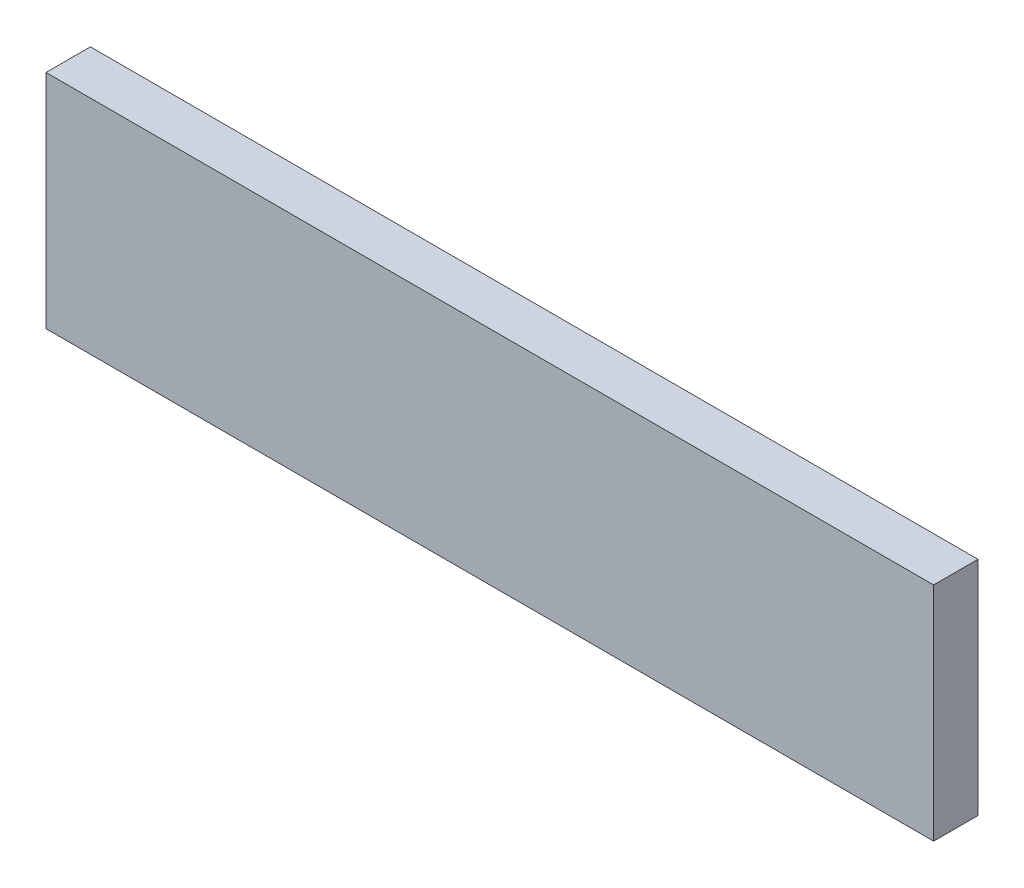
from build123d import *

# Parameters (mm, degrees)
ESQUISSE1_W      = 200
ESQUISSE1_H      = 50
EXTRUSION1_DEPTH = 10


with BuildPart() as part:
    # Esquisse1 → Extrusion1 (new body)
    with BuildSketch(Plane.XY):
        with Locations((100, 25)):
            Rectangle(ESQUISSE1_W, ESQUISSE1_H)
    extrude(amount=EXTRUSION1_DEPTH)


solid = part.part
